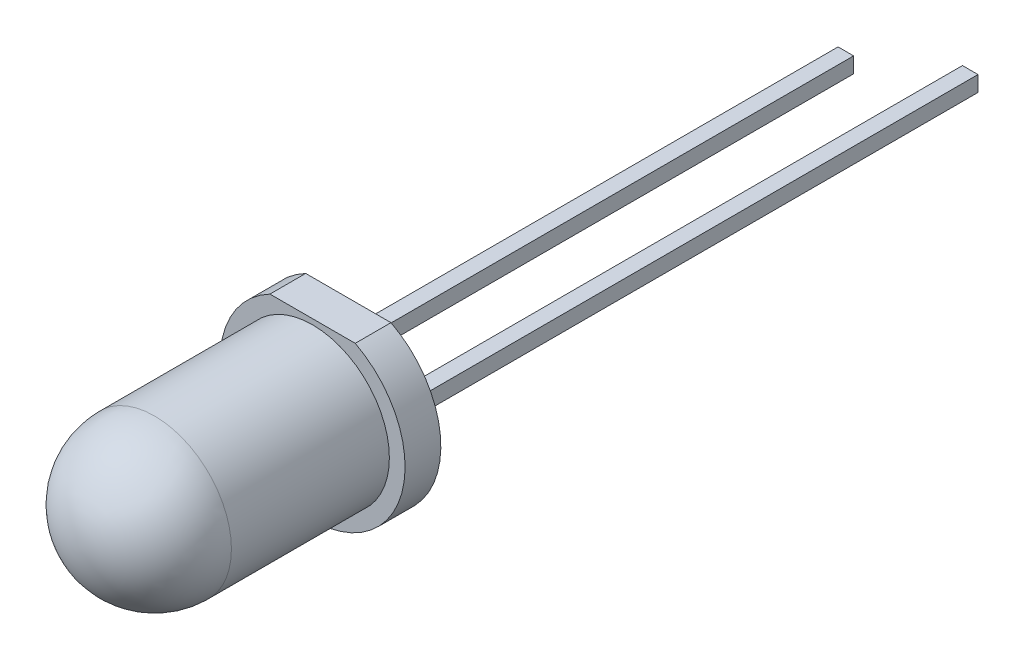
from build123d import *

# Parameters (mm, degrees)
SKETCH1_R      = 2.975
EXTRUDE1_DEPTH = 0.575
SKETCH2_R      = 2.47
EXTRUDE2_DEPTH = 7.55
FILLET2_R      = 2.47
SKETCH4_W      = 13.081078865
SKETCH4_H      = 5.810496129
EXTRUDE3_DEPTH = 0.36
SKETCH5_W      = 0.5
SKETCH5_H      = 0.5
EXTRUDE4_DEPTH = 20
SKETCH6_W      = 0.5
SKETCH6_H      = 0.5
EXTRUDE5_DEPTH = 4


with BuildPart() as part:
    # Sketch1 → Extrude1 (new, symmetric)
    with BuildSketch(Plane.XY):
        Circle(SKETCH1_R)
    extrude(amount=EXTRUDE1_DEPTH, both=True)

    # Sketch2 → Extrude2 (add)
    with BuildSketch(Plane.XY.offset(0.575)):
        Circle(SKETCH2_R)
    extrude(amount=EXTRUDE2_DEPTH)

    # Fillet2
    fillet2_edges = [part.edges().sort_by_distance(p)[0] for p in [
        (-2.47, 0, 8.125),
    ]]
    fillet(fillet2_edges, radius=FILLET2_R)

    # Sketch4 → Extrude3 (cut)
    with BuildSketch(Plane(origin=(0, 3, 0), x_dir=(-1, 0, 0), z_dir=(0, 1, 0))):
        with Locations((-1.941605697, 0.17278636)):
            Rectangle(SKETCH4_W, SKETCH4_H)
    extrude(amount=-EXTRUDE3_DEPTH, mode=Mode.SUBTRACT)

    # Sketch5 → Extrude4 (add)
    with BuildSketch(Plane(origin=(0, 0, -0.575), x_dir=(-1, 0, 0), z_dir=(0, 0, -1))):
        with Locations((0, 1.26)):
            Rectangle(SKETCH5_W, SKETCH5_H)
        with Locations((0, -1.26)):
            Rectangle(SKETCH5_W, SKETCH5_H)
    extrude(amount=EXTRUDE4_DEPTH)

    # Sketch6 → Extrude5 (cut)
    with BuildSketch(Plane(origin=(0, 0, -20.575), x_dir=(-1, 0, 0), z_dir=(0, 0, -1))):
        with Locations((0, 1.26)):
            Rectangle(SKETCH6_W, SKETCH6_H)
    extrude(amount=-EXTRUDE5_DEPTH, mode=Mode.SUBTRACT)


solid = part.part
